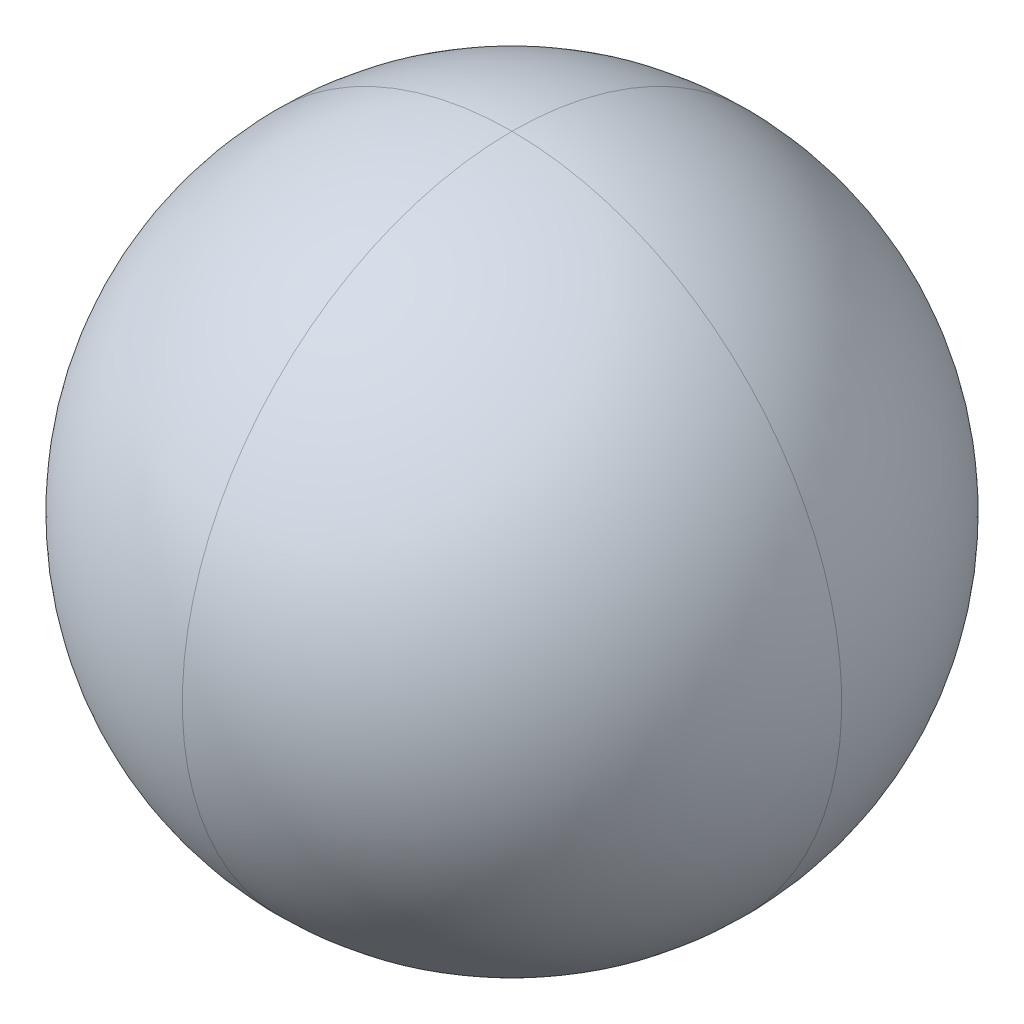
from build123d import *


with BuildPart() as part:
    # Sketch1 → Base-Revolve (revolve)
    with BuildSketch(Plane.XY):
        with BuildLine():
            Line((0, 25.4), (0, -25.4))
            ThreePointArc((0, -25.4), (25.4, 0), (0, 25.4))
        make_face()
    revolve(axis=Axis((0, 25.4, 0), (0, -1, 0)))


solid = part.part
